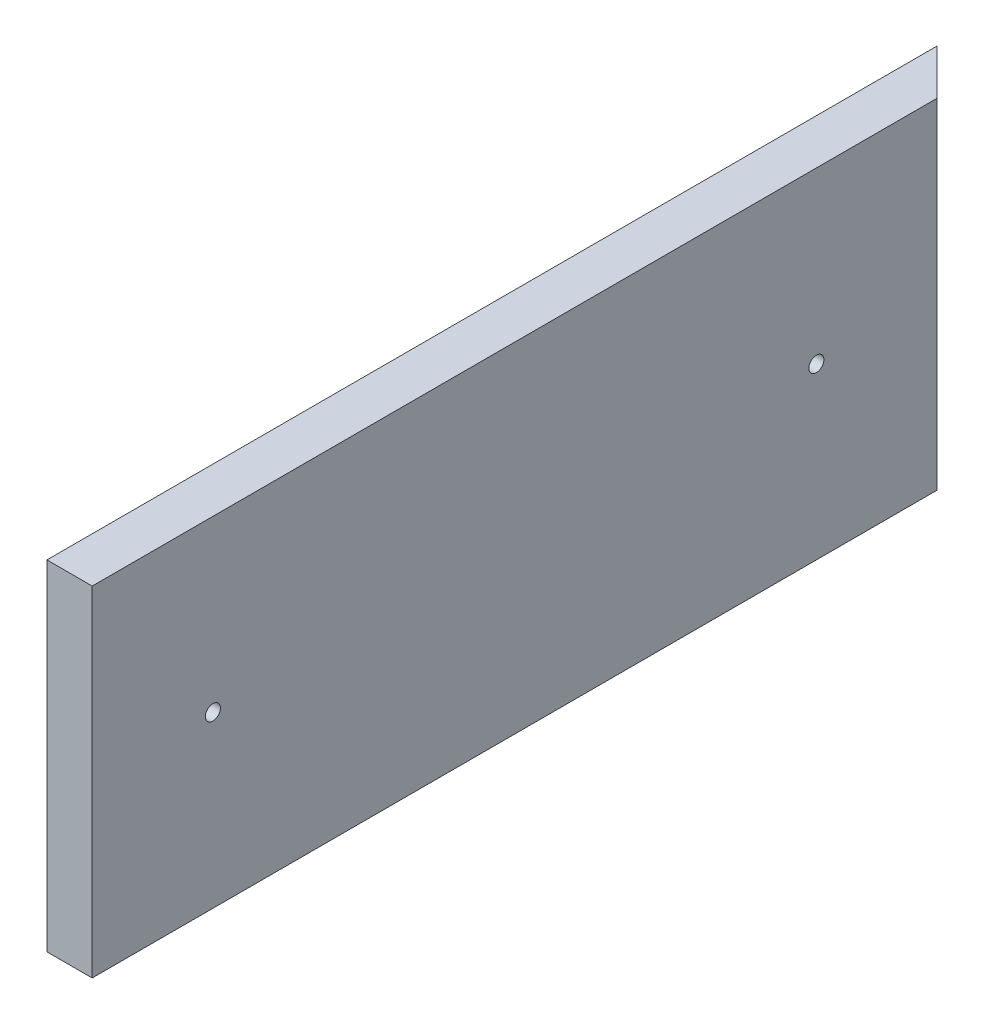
from build123d import *

# Parameters (mm, degrees)
SKETCH2_W           = 38.1
SKETCH2_H           = 285.75
BOSS_EXTRUDE1_DEPTH = 711.2
BOSS_EXTRUDE2_DEPTH = 285.75
SKETCH4_R           = 6.35
CUT_EXTRUDE1_DEPTH  = 768.404790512


with BuildPart() as part:
    # Sketch2 → Boss-Extrude1 (new body)
    with BuildSketch(Plane.XY):
        with Locations((19.05, 142.875)):
            Rectangle(SKETCH2_W, SKETCH2_H)
    extrude(amount=BOSS_EXTRUDE1_DEPTH)

    # Sketch3 → Boss-Extrude2 (add)
    with BuildSketch(Plane(origin=(0, 285.75, 0), x_dir=(1, 0, 0), z_dir=(0, 1, 0))):
        Polygon((38.1, 0), (0, 0), (0, 38.1), align=None)
    extrude(amount=-BOSS_EXTRUDE2_DEPTH)

    # Sketch4 → Cut-Extrude1 (cut, through all)
    with BuildSketch(Plane(origin=(38.1, 0, 0), x_dir=(0, 0, -1), z_dir=(1, 0, 0))):
        with Locations((-609.6, 142.875)):
            Circle(SKETCH4_R)
        with Locations((-101.6, 142.875)):
            Circle(SKETCH4_R)
    extrude(amount=-CUT_EXTRUDE1_DEPTH, mode=Mode.SUBTRACT)


solid = part.part
